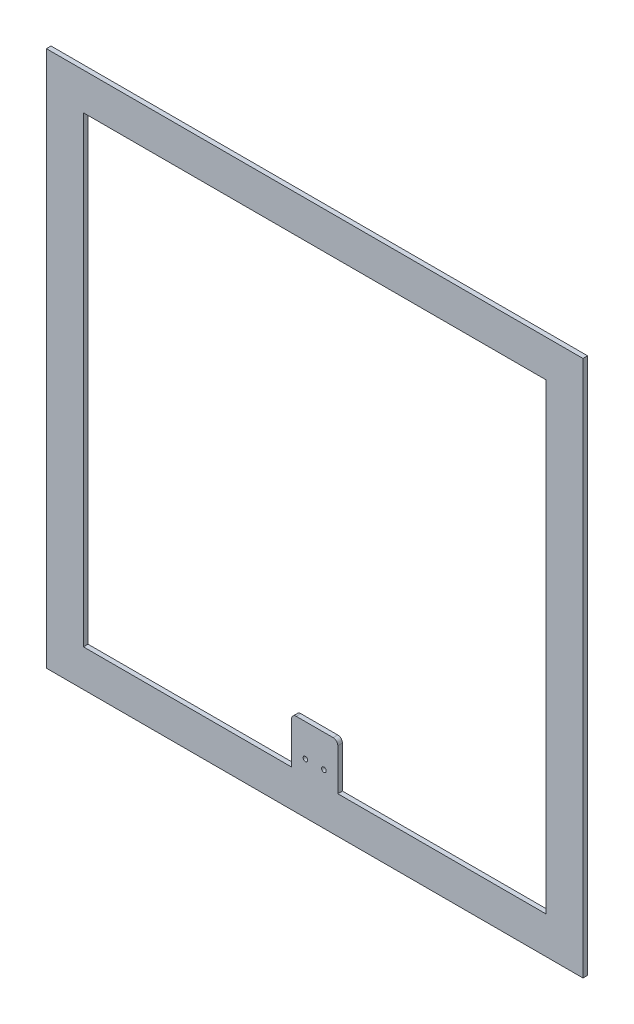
ISO-10303-21;
HEADER;
FILE_DESCRIPTION(('STEP AP214'),'2;1');
FILE_NAME('part.step','',(''),(''),'','','');
FILE_SCHEMA(('AUTOMOTIVE_DESIGN { 1 0 10303 214 1 1 1 1 }'));
ENDSEC;
DATA;
#1=APPLICATION_CONTEXT('core data for automotive mechanical design processes');
#2=APPLICATION_PROTOCOL_DEFINITION('international standard','automotive_design',2000,#1);
#3=PRODUCT_CONTEXT('',#1,'mechanical');
#4=PRODUCT('Part','Part','',(#3));
#5=PRODUCT_RELATED_PRODUCT_CATEGORY('part','',(#4));
#6=PRODUCT_DEFINITION_FORMATION('','',#4);
#7=PRODUCT_DEFINITION_CONTEXT('part definition',#1,'design');
#8=PRODUCT_DEFINITION('design','',#6,#7);
#9=PRODUCT_DEFINITION_SHAPE('','',#8);
#10=(LENGTH_UNIT() NAMED_UNIT(*) SI_UNIT(.MILLI.,.METRE.));
#11=(NAMED_UNIT(*) PLANE_ANGLE_UNIT() SI_UNIT($,.RADIAN.));
#12=(NAMED_UNIT(*) SI_UNIT($,.STERADIAN.) SOLID_ANGLE_UNIT());
#13=UNCERTAINTY_MEASURE_WITH_UNIT(LENGTH_MEASURE(1.E-05),#10,'distance_accuracy_value','');
#14=(GEOMETRIC_REPRESENTATION_CONTEXT(3) GLOBAL_UNCERTAINTY_ASSIGNED_CONTEXT((#13)) GLOBAL_UNIT_ASSIGNED_CONTEXT((#10,
#11,#12)) REPRESENTATION_CONTEXT('',''));
#15=CARTESIAN_POINT('',(0.,0.,0.));
#16=DIRECTION('',(0.,0.,1.));
#17=DIRECTION('',(1.,0.,0.));
#18=AXIS2_PLACEMENT_3D('',#15,#16,#17);
#19=CARTESIAN_POINT('',(0.,0.,5.));
#20=DIRECTION('',(0.,0.,1.));
#21=DIRECTION('',(1.,0.,0.));
#22=AXIS2_PLACEMENT_3D('',#19,#20,#21);
#23=PLANE('',#22);
#24=CARTESIAN_POINT('',(10.,-235.,5.));
#25=DIRECTION('',(0.,0.,1.));
#26=DIRECTION('',(-1.,0.,0.));
#27=AXIS2_PLACEMENT_3D('',#24,#25,#26);
#28=CIRCLE('',#27,2.5);
#29=CARTESIAN_POINT('',(7.5,-235.,5.));
#30=VERTEX_POINT('',#29);
#31=EDGE_CURVE('E306',#30,#30,#28,.T.);
#32=ORIENTED_EDGE('',*,*,#31,.F.);
#33=EDGE_LOOP('',(#32));
#34=FACE_BOUND('',#33,.T.);
#35=CARTESIAN_POINT('',(-10.,-235.,5.));
#36=DIRECTION('',(0.,0.,1.));
#37=DIRECTION('',(1.,0.,0.));
#38=AXIS2_PLACEMENT_3D('',#35,#36,#37);
#39=CIRCLE('',#38,2.5);
#40=CARTESIAN_POINT('',(-7.5,-235.,5.));
#41=VERTEX_POINT('',#40);
#42=EDGE_CURVE('E310',#41,#41,#39,.T.);
#43=ORIENTED_EDGE('',*,*,#42,.F.);
#44=EDGE_LOOP('',(#43));
#45=FACE_BOUND('',#44,.T.);
#46=DIRECTION('',(0.,1.,0.));
#47=VECTOR('',#46,1.);
#48=CARTESIAN_POINT('',(290.,290.,5.));
#49=LINE('',#48,#47);
#50=CARTESIAN_POINT('',(290.,-290.,5.));
#51=VERTEX_POINT('',#50);
#52=CARTESIAN_POINT('',(290.,290.,5.));
#53=VERTEX_POINT('',#52);
#54=EDGE_CURVE('E204',#51,#53,#49,.T.);
#55=ORIENTED_EDGE('',*,*,#54,.T.);
#56=DIRECTION('',(-1.,0.,0.));
#57=VECTOR('',#56,1.);
#58=CARTESIAN_POINT('',(-290.,290.,5.));
#59=LINE('',#58,#57);
#60=CARTESIAN_POINT('',(-290.,290.,5.));
#61=VERTEX_POINT('',#60);
#62=EDGE_CURVE('E207',#53,#61,#59,.T.);
#63=ORIENTED_EDGE('',*,*,#62,.T.);
#64=DIRECTION('',(0.,-1.,0.));
#65=VECTOR('',#64,1.);
#66=CARTESIAN_POINT('',(-290.,290.,5.));
#67=LINE('',#66,#65);
#68=CARTESIAN_POINT('',(-290.,-290.,5.));
#69=VERTEX_POINT('',#68);
#70=EDGE_CURVE('E210',#61,#69,#67,.T.);
#71=ORIENTED_EDGE('',*,*,#70,.T.);
#72=DIRECTION('',(1.,0.,0.));
#73=VECTOR('',#72,1.);
#74=CARTESIAN_POINT('',(-290.,-290.,5.));
#75=LINE('',#74,#73);
#76=EDGE_CURVE('E212',#69,#51,#75,.T.);
#77=ORIENTED_EDGE('',*,*,#76,.T.);
#78=EDGE_LOOP('',(#55,#63,#71,#77));
#79=FACE_BOUND('',#78,.T.);
#80=DIRECTION('',(0.,-1.,0.));
#81=VECTOR('',#80,1.);
#82=CARTESIAN_POINT('',(25.,-250.,5.));
#83=LINE('',#82,#81);
#84=CARTESIAN_POINT('',(25.,-205.,5.));
#85=VERTEX_POINT('',#84);
#86=CARTESIAN_POINT('',(25.,-250.,5.));
#87=VERTEX_POINT('',#86);
#88=EDGE_CURVE('E174',#85,#87,#83,.T.);
#89=ORIENTED_EDGE('',*,*,#88,.F.);
#90=CARTESIAN_POINT('',(20.,-205.,5.));
#91=DIRECTION('',(0.,0.,1.));
#92=DIRECTION('',(1.,0.,0.));
#93=AXIS2_PLACEMENT_3D('',#90,#91,#92);
#94=CIRCLE('',#93,5.);
#95=CARTESIAN_POINT('',(20.,-200.,5.));
#96=VERTEX_POINT('',#95);
#97=EDGE_CURVE('E41',#85,#96,#94,.T.);
#98=ORIENTED_EDGE('',*,*,#97,.T.);
#99=DIRECTION('',(1.,0.,0.));
#100=VECTOR('',#99,1.);
#101=CARTESIAN_POINT('',(-25.,-200.,5.));
#102=LINE('',#101,#100);
#103=CARTESIAN_POINT('',(-20.,-200.,5.));
#104=VERTEX_POINT('',#103);
#105=EDGE_CURVE('E171',#104,#96,#102,.T.);
#106=ORIENTED_EDGE('',*,*,#105,.F.);
#107=CARTESIAN_POINT('',(-20.,-205.,5.));
#108=DIRECTION('',(0.,0.,1.));
#109=DIRECTION('',(1.,0.,0.));
#110=AXIS2_PLACEMENT_3D('',#107,#108,#109);
#111=CIRCLE('',#110,5.);
#112=CARTESIAN_POINT('',(-25.,-205.,5.));
#113=VERTEX_POINT('',#112);
#114=EDGE_CURVE('E48',#104,#113,#111,.T.);
#115=ORIENTED_EDGE('',*,*,#114,.T.);
#116=DIRECTION('',(0.,1.,0.));
#117=VECTOR('',#116,1.);
#118=CARTESIAN_POINT('',(-25.,-250.,5.));
#119=LINE('',#118,#117);
#120=CARTESIAN_POINT('',(-25.,-250.,5.));
#121=VERTEX_POINT('',#120);
#122=EDGE_CURVE('E169',#121,#113,#119,.T.);
#123=ORIENTED_EDGE('',*,*,#122,.F.);
#124=DIRECTION('',(1.,0.,0.));
#125=VECTOR('',#124,1.);
#126=CARTESIAN_POINT('',(-250.,-250.,5.));
#127=LINE('',#126,#125);
#128=CARTESIAN_POINT('',(-250.,-250.,5.));
#129=VERTEX_POINT('',#128);
#130=EDGE_CURVE('E167',#129,#121,#127,.T.);
#131=ORIENTED_EDGE('',*,*,#130,.F.);
#132=DIRECTION('',(0.,-1.,0.));
#133=VECTOR('',#132,1.);
#134=CARTESIAN_POINT('',(-250.,250.,5.));
#135=LINE('',#134,#133);
#136=CARTESIAN_POINT('',(-250.,250.,5.));
#137=VERTEX_POINT('',#136);
#138=EDGE_CURVE('E162',#137,#129,#135,.T.);
#139=ORIENTED_EDGE('',*,*,#138,.F.);
#140=DIRECTION('',(-1.,0.,0.));
#141=VECTOR('',#140,1.);
#142=CARTESIAN_POINT('',(-250.,250.,5.));
#143=LINE('',#142,#141);
#144=CARTESIAN_POINT('',(250.,250.,5.));
#145=VERTEX_POINT('',#144);
#146=EDGE_CURVE('E160',#145,#137,#143,.T.);
#147=ORIENTED_EDGE('',*,*,#146,.F.);
#148=DIRECTION('',(0.,1.,0.));
#149=VECTOR('',#148,1.);
#150=CARTESIAN_POINT('',(250.,250.,5.));
#151=LINE('',#150,#149);
#152=CARTESIAN_POINT('',(250.,-250.,5.));
#153=VERTEX_POINT('',#152);
#154=EDGE_CURVE('E147',#153,#145,#151,.T.);
#155=ORIENTED_EDGE('',*,*,#154,.F.);
#156=DIRECTION('',(1.,0.,0.));
#157=VECTOR('',#156,1.);
#158=CARTESIAN_POINT('',(25.,-250.,5.));
#159=LINE('',#158,#157);
#160=EDGE_CURVE('E138',#87,#153,#159,.T.);
#161=ORIENTED_EDGE('',*,*,#160,.F.);
#162=EDGE_LOOP('',(#89,#98,#106,#115,#123,#131,#139,#147,#155,#161));
#163=FACE_BOUND('',#162,.T.);
#164=ADVANCED_FACE('F33',(#34,#45,#79,#163),#23,.T.);
#165=CARTESIAN_POINT('',(0.,0.,0.));
#166=DIRECTION('',(0.,0.,1.));
#167=DIRECTION('',(1.,0.,0.));
#168=AXIS2_PLACEMENT_3D('',#165,#166,#167);
#169=PLANE('',#168);
#170=CARTESIAN_POINT('',(10.,-235.,0.));
#171=DIRECTION('',(0.,0.,1.));
#172=DIRECTION('',(1.,0.,0.));
#173=AXIS2_PLACEMENT_3D('',#170,#171,#172);
#174=CIRCLE('',#173,2.5);
#175=CARTESIAN_POINT('',(12.5,-235.,0.));
#176=VERTEX_POINT('',#175);
#177=EDGE_CURVE('E309',#176,#176,#174,.F.);
#178=ORIENTED_EDGE('',*,*,#177,.F.);
#179=EDGE_LOOP('',(#178));
#180=FACE_BOUND('',#179,.T.);
#181=CARTESIAN_POINT('',(-10.,-235.,0.));
#182=DIRECTION('',(0.,0.,1.));
#183=DIRECTION('',(1.,0.,0.));
#184=AXIS2_PLACEMENT_3D('',#181,#182,#183);
#185=CIRCLE('',#184,2.5);
#186=CARTESIAN_POINT('',(-7.5,-235.,0.));
#187=VERTEX_POINT('',#186);
#188=EDGE_CURVE('E178',#187,#187,#185,.F.);
#189=ORIENTED_EDGE('',*,*,#188,.F.);
#190=EDGE_LOOP('',(#189));
#191=FACE_BOUND('',#190,.T.);
#192=DIRECTION('',(0.,1.,0.));
#193=VECTOR('',#192,1.);
#194=CARTESIAN_POINT('',(290.,290.,0.));
#195=LINE('',#194,#193);
#196=CARTESIAN_POINT('',(290.,-290.,0.));
#197=VERTEX_POINT('',#196);
#198=CARTESIAN_POINT('',(290.,290.,0.));
#199=VERTEX_POINT('',#198);
#200=EDGE_CURVE('E155',#197,#199,#195,.T.);
#201=ORIENTED_EDGE('',*,*,#200,.F.);
#202=DIRECTION('',(1.,0.,0.));
#203=VECTOR('',#202,1.);
#204=CARTESIAN_POINT('',(-290.,-290.,0.));
#205=LINE('',#204,#203);
#206=CARTESIAN_POINT('',(-290.,-290.,0.));
#207=VERTEX_POINT('',#206);
#208=EDGE_CURVE('E208',#207,#197,#205,.T.);
#209=ORIENTED_EDGE('',*,*,#208,.F.);
#210=DIRECTION('',(0.,-1.,0.));
#211=VECTOR('',#210,1.);
#212=CARTESIAN_POINT('',(-290.,290.,0.));
#213=LINE('',#212,#211);
#214=CARTESIAN_POINT('',(-290.,290.,0.));
#215=VERTEX_POINT('',#214);
#216=EDGE_CURVE('E219',#215,#207,#213,.T.);
#217=ORIENTED_EDGE('',*,*,#216,.F.);
#218=DIRECTION('',(-1.,0.,0.));
#219=VECTOR('',#218,1.);
#220=CARTESIAN_POINT('',(-290.,290.,0.));
#221=LINE('',#220,#219);
#222=EDGE_CURVE('E217',#199,#215,#221,.T.);
#223=ORIENTED_EDGE('',*,*,#222,.F.);
#224=EDGE_LOOP('',(#201,#209,#217,#223));
#225=FACE_BOUND('',#224,.T.);
#226=DIRECTION('',(1.,0.,0.));
#227=VECTOR('',#226,1.);
#228=CARTESIAN_POINT('',(-25.,-200.,0.));
#229=LINE('',#228,#227);
#230=CARTESIAN_POINT('',(-20.,-200.,0.));
#231=VERTEX_POINT('',#230);
#232=CARTESIAN_POINT('',(20.,-200.,0.));
#233=VERTEX_POINT('',#232);
#234=EDGE_CURVE('E192',#231,#233,#229,.T.);
#235=ORIENTED_EDGE('',*,*,#234,.T.);
#236=CARTESIAN_POINT('',(20.,-205.,0.));
#237=DIRECTION('',(0.,0.,1.));
#238=DIRECTION('',(1.,0.,0.));
#239=AXIS2_PLACEMENT_3D('',#236,#237,#238);
#240=CIRCLE('',#239,5.);
#241=CARTESIAN_POINT('',(25.,-205.,0.));
#242=VERTEX_POINT('',#241);
#243=EDGE_CURVE('E240',#233,#242,#240,.F.);
#244=ORIENTED_EDGE('',*,*,#243,.T.);
#245=DIRECTION('',(0.,-1.,0.));
#246=VECTOR('',#245,1.);
#247=CARTESIAN_POINT('',(25.,-250.,0.));
#248=LINE('',#247,#246);
#249=CARTESIAN_POINT('',(25.,-250.,0.));
#250=VERTEX_POINT('',#249);
#251=EDGE_CURVE('E148',#242,#250,#248,.T.);
#252=ORIENTED_EDGE('',*,*,#251,.T.);
#253=DIRECTION('',(1.,0.,0.));
#254=VECTOR('',#253,1.);
#255=CARTESIAN_POINT('',(25.,-250.,0.));
#256=LINE('',#255,#254);
#257=CARTESIAN_POINT('',(250.,-250.,0.));
#258=VERTEX_POINT('',#257);
#259=EDGE_CURVE('E176',#250,#258,#256,.T.);
#260=ORIENTED_EDGE('',*,*,#259,.T.);
#261=DIRECTION('',(0.,1.,0.));
#262=VECTOR('',#261,1.);
#263=CARTESIAN_POINT('',(250.,250.,0.));
#264=LINE('',#263,#262);
#265=CARTESIAN_POINT('',(250.,250.,0.));
#266=VERTEX_POINT('',#265);
#267=EDGE_CURVE('E154',#258,#266,#264,.T.);
#268=ORIENTED_EDGE('',*,*,#267,.T.);
#269=DIRECTION('',(-1.,0.,0.));
#270=VECTOR('',#269,1.);
#271=CARTESIAN_POINT('',(-250.,250.,0.));
#272=LINE('',#271,#270);
#273=CARTESIAN_POINT('',(-250.,250.,0.));
#274=VERTEX_POINT('',#273);
#275=EDGE_CURVE('E180',#266,#274,#272,.T.);
#276=ORIENTED_EDGE('',*,*,#275,.T.);
#277=DIRECTION('',(0.,-1.,0.));
#278=VECTOR('',#277,1.);
#279=CARTESIAN_POINT('',(-250.,250.,0.));
#280=LINE('',#279,#278);
#281=CARTESIAN_POINT('',(-250.,-250.,0.));
#282=VERTEX_POINT('',#281);
#283=EDGE_CURVE('E183',#274,#282,#280,.T.);
#284=ORIENTED_EDGE('',*,*,#283,.T.);
#285=DIRECTION('',(1.,0.,0.));
#286=VECTOR('',#285,1.);
#287=CARTESIAN_POINT('',(-250.,-250.,0.));
#288=LINE('',#287,#286);
#289=CARTESIAN_POINT('',(-25.,-250.,0.));
#290=VERTEX_POINT('',#289);
#291=EDGE_CURVE('E186',#282,#290,#288,.T.);
#292=ORIENTED_EDGE('',*,*,#291,.T.);
#293=DIRECTION('',(0.,1.,0.));
#294=VECTOR('',#293,1.);
#295=CARTESIAN_POINT('',(-25.,-250.,0.));
#296=LINE('',#295,#294);
#297=CARTESIAN_POINT('',(-25.,-205.,0.));
#298=VERTEX_POINT('',#297);
#299=EDGE_CURVE('E189',#290,#298,#296,.T.);
#300=ORIENTED_EDGE('',*,*,#299,.T.);
#301=CARTESIAN_POINT('',(-20.,-205.,0.));
#302=DIRECTION('',(0.,0.,1.));
#303=DIRECTION('',(1.,0.,0.));
#304=AXIS2_PLACEMENT_3D('',#301,#302,#303);
#305=CIRCLE('',#304,5.);
#306=EDGE_CURVE('E238',#298,#231,#305,.F.);
#307=ORIENTED_EDGE('',*,*,#306,.T.);
#308=EDGE_LOOP('',(#235,#244,#252,#260,#268,#276,#284,#292,#300,#307));
#309=FACE_BOUND('',#308,.T.);
#310=ADVANCED_FACE('F252',(#180,#191,#225,#309),#169,.F.);
#311=CARTESIAN_POINT('',(290.,290.,5.));
#312=DIRECTION('',(-1.,0.,0.));
#313=DIRECTION('',(0.,0.,1.));
#314=AXIS2_PLACEMENT_3D('',#311,#312,#313);
#315=PLANE('',#314);
#316=ORIENTED_EDGE('',*,*,#200,.T.);
#317=DIRECTION('',(0.,0.,-1.));
#318=VECTOR('',#317,1.);
#319=CARTESIAN_POINT('',(290.,290.,5.));
#320=LINE('',#319,#318);
#321=EDGE_CURVE('E230',#53,#199,#320,.T.);
#322=ORIENTED_EDGE('',*,*,#321,.F.);
#323=ORIENTED_EDGE('',*,*,#54,.F.);
#324=DIRECTION('',(0.,0.,-1.));
#325=VECTOR('',#324,1.);
#326=CARTESIAN_POINT('',(290.,-290.,5.));
#327=LINE('',#326,#325);
#328=EDGE_CURVE('E214',#51,#197,#327,.T.);
#329=ORIENTED_EDGE('',*,*,#328,.T.);
#330=EDGE_LOOP('',(#316,#322,#323,#329));
#331=FACE_BOUND('',#330,.T.);
#332=ADVANCED_FACE('F274',(#331),#315,.F.);
#333=CARTESIAN_POINT('',(-290.,290.,5.));
#334=DIRECTION('',(0.,-1.,0.));
#335=DIRECTION('',(0.,0.,-1.));
#336=AXIS2_PLACEMENT_3D('',#333,#334,#335);
#337=PLANE('',#336);
#338=ORIENTED_EDGE('',*,*,#222,.T.);
#339=DIRECTION('',(0.,0.,-1.));
#340=VECTOR('',#339,1.);
#341=CARTESIAN_POINT('',(-290.,290.,5.));
#342=LINE('',#341,#340);
#343=EDGE_CURVE('E227',#61,#215,#342,.T.);
#344=ORIENTED_EDGE('',*,*,#343,.F.);
#345=ORIENTED_EDGE('',*,*,#62,.F.);
#346=ORIENTED_EDGE('',*,*,#321,.T.);
#347=EDGE_LOOP('',(#338,#344,#345,#346));
#348=FACE_BOUND('',#347,.T.);
#349=ADVANCED_FACE('F289',(#348),#337,.F.);
#350=CARTESIAN_POINT('',(-290.,290.,5.));
#351=DIRECTION('',(1.,0.,0.));
#352=DIRECTION('',(0.,0.,-1.));
#353=AXIS2_PLACEMENT_3D('',#350,#351,#352);
#354=PLANE('',#353);
#355=ORIENTED_EDGE('',*,*,#216,.T.);
#356=DIRECTION('',(0.,0.,-1.));
#357=VECTOR('',#356,1.);
#358=CARTESIAN_POINT('',(-290.,-290.,5.));
#359=LINE('',#358,#357);
#360=EDGE_CURVE('E224',#69,#207,#359,.T.);
#361=ORIENTED_EDGE('',*,*,#360,.F.);
#362=ORIENTED_EDGE('',*,*,#70,.F.);
#363=ORIENTED_EDGE('',*,*,#343,.T.);
#364=EDGE_LOOP('',(#355,#361,#362,#363));
#365=FACE_BOUND('',#364,.T.);
#366=ADVANCED_FACE('F285',(#365),#354,.F.);
#367=CARTESIAN_POINT('',(-290.,-290.,5.));
#368=DIRECTION('',(0.,1.,0.));
#369=DIRECTION('',(0.,0.,1.));
#370=AXIS2_PLACEMENT_3D('',#367,#368,#369);
#371=PLANE('',#370);
#372=ORIENTED_EDGE('',*,*,#208,.T.);
#373=ORIENTED_EDGE('',*,*,#328,.F.);
#374=ORIENTED_EDGE('',*,*,#76,.F.);
#375=ORIENTED_EDGE('',*,*,#360,.T.);
#376=EDGE_LOOP('',(#372,#373,#374,#375));
#377=FACE_BOUND('',#376,.T.);
#378=ADVANCED_FACE('F282',(#377),#371,.F.);
#379=CARTESIAN_POINT('',(25.,-250.,5.));
#380=DIRECTION('',(0.,1.,0.));
#381=DIRECTION('',(0.,0.,1.));
#382=AXIS2_PLACEMENT_3D('',#379,#380,#381);
#383=PLANE('',#382);
#384=ORIENTED_EDGE('',*,*,#259,.F.);
#385=DIRECTION('',(0.,0.,-1.));
#386=VECTOR('',#385,1.);
#387=CARTESIAN_POINT('',(25.,-250.,5.));
#388=LINE('',#387,#386);
#389=EDGE_CURVE('E145',#87,#250,#388,.T.);
#390=ORIENTED_EDGE('',*,*,#389,.F.);
#391=ORIENTED_EDGE('',*,*,#160,.T.);
#392=DIRECTION('',(0.,0.,-1.));
#393=VECTOR('',#392,1.);
#394=CARTESIAN_POINT('',(250.,-250.,5.));
#395=LINE('',#394,#393);
#396=EDGE_CURVE('E142',#153,#258,#395,.T.);
#397=ORIENTED_EDGE('',*,*,#396,.T.);
#398=EDGE_LOOP('',(#384,#390,#391,#397));
#399=FACE_BOUND('',#398,.T.);
#400=ADVANCED_FACE('F141',(#399),#383,.T.);
#401=CARTESIAN_POINT('',(250.,250.,5.));
#402=DIRECTION('',(-1.,0.,0.));
#403=DIRECTION('',(0.,0.,1.));
#404=AXIS2_PLACEMENT_3D('',#401,#402,#403);
#405=PLANE('',#404);
#406=ORIENTED_EDGE('',*,*,#267,.F.);
#407=ORIENTED_EDGE('',*,*,#396,.F.);
#408=ORIENTED_EDGE('',*,*,#154,.T.);
#409=DIRECTION('',(0.,0.,-1.));
#410=VECTOR('',#409,1.);
#411=CARTESIAN_POINT('',(250.,250.,5.));
#412=LINE('',#411,#410);
#413=EDGE_CURVE('E156',#145,#266,#412,.T.);
#414=ORIENTED_EDGE('',*,*,#413,.T.);
#415=EDGE_LOOP('',(#406,#407,#408,#414));
#416=FACE_BOUND('',#415,.T.);
#417=ADVANCED_FACE('F151',(#416),#405,.T.);
#418=CARTESIAN_POINT('',(-250.,250.,5.));
#419=DIRECTION('',(0.,-1.,0.));
#420=DIRECTION('',(0.,0.,-1.));
#421=AXIS2_PLACEMENT_3D('',#418,#419,#420);
#422=PLANE('',#421);
#423=ORIENTED_EDGE('',*,*,#275,.F.);
#424=ORIENTED_EDGE('',*,*,#413,.F.);
#425=ORIENTED_EDGE('',*,*,#146,.T.);
#426=DIRECTION('',(0.,0.,-1.));
#427=VECTOR('',#426,1.);
#428=CARTESIAN_POINT('',(-250.,250.,5.));
#429=LINE('',#428,#427);
#430=EDGE_CURVE('E201',#137,#274,#429,.T.);
#431=ORIENTED_EDGE('',*,*,#430,.T.);
#432=EDGE_LOOP('',(#423,#424,#425,#431));
#433=FACE_BOUND('',#432,.T.);
#434=ADVANCED_FACE('F370',(#433),#422,.T.);
#435=CARTESIAN_POINT('',(-250.,250.,5.));
#436=DIRECTION('',(1.,0.,0.));
#437=DIRECTION('',(0.,0.,-1.));
#438=AXIS2_PLACEMENT_3D('',#435,#436,#437);
#439=PLANE('',#438);
#440=ORIENTED_EDGE('',*,*,#283,.F.);
#441=ORIENTED_EDGE('',*,*,#430,.F.);
#442=ORIENTED_EDGE('',*,*,#138,.T.);
#443=DIRECTION('',(0.,0.,-1.));
#444=VECTOR('',#443,1.);
#445=CARTESIAN_POINT('',(-250.,-250.,5.));
#446=LINE('',#445,#444);
#447=EDGE_CURVE('E199',#129,#282,#446,.T.);
#448=ORIENTED_EDGE('',*,*,#447,.T.);
#449=EDGE_LOOP('',(#440,#441,#442,#448));
#450=FACE_BOUND('',#449,.T.);
#451=ADVANCED_FACE('F363',(#450),#439,.T.);
#452=CARTESIAN_POINT('',(-250.,-250.,5.));
#453=DIRECTION('',(0.,1.,0.));
#454=DIRECTION('',(0.,0.,1.));
#455=AXIS2_PLACEMENT_3D('',#452,#453,#454);
#456=PLANE('',#455);
#457=ORIENTED_EDGE('',*,*,#291,.F.);
#458=ORIENTED_EDGE('',*,*,#447,.F.);
#459=ORIENTED_EDGE('',*,*,#130,.T.);
#460=DIRECTION('',(0.,0.,-1.));
#461=VECTOR('',#460,1.);
#462=CARTESIAN_POINT('',(-25.,-250.,5.));
#463=LINE('',#462,#461);
#464=EDGE_CURVE('E197',#121,#290,#463,.T.);
#465=ORIENTED_EDGE('',*,*,#464,.T.);
#466=EDGE_LOOP('',(#457,#458,#459,#465));
#467=FACE_BOUND('',#466,.T.);
#468=ADVANCED_FACE('F354',(#467),#456,.T.);
#469=CARTESIAN_POINT('',(-25.,-250.,5.));
#470=DIRECTION('',(-1.,0.,0.));
#471=DIRECTION('',(0.,-1.,0.));
#472=AXIS2_PLACEMENT_3D('',#469,#470,#471);
#473=PLANE('',#472);
#474=ORIENTED_EDGE('',*,*,#122,.T.);
#475=DIRECTION('',(0.,0.,-1.));
#476=VECTOR('',#475,1.);
#477=CARTESIAN_POINT('',(-25.,-205.,5.));
#478=LINE('',#477,#476);
#479=EDGE_CURVE('E11',#113,#298,#478,.T.);
#480=ORIENTED_EDGE('',*,*,#479,.T.);
#481=ORIENTED_EDGE('',*,*,#299,.F.);
#482=ORIENTED_EDGE('',*,*,#464,.F.);
#483=EDGE_LOOP('',(#474,#480,#481,#482));
#484=FACE_BOUND('',#483,.T.);
#485=ADVANCED_FACE('F265',(#484),#473,.T.);
#486=CARTESIAN_POINT('',(-25.,-200.,5.));
#487=DIRECTION('',(0.,1.,0.));
#488=DIRECTION('',(0.,0.,1.));
#489=AXIS2_PLACEMENT_3D('',#486,#487,#488);
#490=PLANE('',#489);
#491=ORIENTED_EDGE('',*,*,#105,.T.);
#492=DIRECTION('',(0.,0.,-1.));
#493=VECTOR('',#492,1.);
#494=CARTESIAN_POINT('',(20.,-200.,5.));
#495=LINE('',#494,#493);
#496=EDGE_CURVE('E235',#96,#233,#495,.T.);
#497=ORIENTED_EDGE('',*,*,#496,.T.);
#498=ORIENTED_EDGE('',*,*,#234,.F.);
#499=DIRECTION('',(0.,0.,-1.));
#500=VECTOR('',#499,1.);
#501=CARTESIAN_POINT('',(-20.,-200.,5.));
#502=LINE('',#501,#500);
#503=EDGE_CURVE('E233',#231,#104,#502,.F.);
#504=ORIENTED_EDGE('',*,*,#503,.T.);
#505=EDGE_LOOP('',(#491,#497,#498,#504));
#506=FACE_BOUND('',#505,.T.);
#507=ADVANCED_FACE('F247',(#506),#490,.T.);
#508=CARTESIAN_POINT('',(25.,-250.,5.));
#509=DIRECTION('',(1.,0.,0.));
#510=DIRECTION('',(0.,1.,0.));
#511=AXIS2_PLACEMENT_3D('',#508,#509,#510);
#512=PLANE('',#511);
#513=ORIENTED_EDGE('',*,*,#251,.F.);
#514=DIRECTION('',(0.,0.,-1.));
#515=VECTOR('',#514,1.);
#516=CARTESIAN_POINT('',(25.,-205.,5.));
#517=LINE('',#516,#515);
#518=EDGE_CURVE('E56',#242,#85,#517,.F.);
#519=ORIENTED_EDGE('',*,*,#518,.T.);
#520=ORIENTED_EDGE('',*,*,#88,.T.);
#521=ORIENTED_EDGE('',*,*,#389,.T.);
#522=EDGE_LOOP('',(#513,#519,#520,#521));
#523=FACE_BOUND('',#522,.T.);
#524=ADVANCED_FACE('F253',(#523),#512,.T.);
#525=CARTESIAN_POINT('',(-10.,-235.,-0.00100000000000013));
#526=DIRECTION('',(0.,0.,1.));
#527=DIRECTION('',(1.,0.,0.));
#528=AXIS2_PLACEMENT_3D('',#525,#526,#527);
#529=CYLINDRICAL_SURFACE('',#528,2.5);
#530=ORIENTED_EDGE('',*,*,#42,.T.);
#531=EDGE_LOOP('',(#530));
#532=FACE_BOUND('',#531,.T.);
#533=ORIENTED_EDGE('',*,*,#188,.T.);
#534=EDGE_LOOP('',(#533));
#535=FACE_BOUND('',#534,.T.);
#536=ADVANCED_FACE('F255',(#532,#535),#529,.F.);
#537=CARTESIAN_POINT('',(10.,-235.,-0.00100000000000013));
#538=DIRECTION('',(0.,0.,1.));
#539=DIRECTION('',(1.,0.,0.));
#540=AXIS2_PLACEMENT_3D('',#537,#538,#539);
#541=CYLINDRICAL_SURFACE('',#540,2.5);
#542=ORIENTED_EDGE('',*,*,#31,.T.);
#543=EDGE_LOOP('',(#542));
#544=FACE_BOUND('',#543,.T.);
#545=ORIENTED_EDGE('',*,*,#177,.T.);
#546=EDGE_LOOP('',(#545));
#547=FACE_BOUND('',#546,.T.);
#548=ADVANCED_FACE('F262',(#544,#547),#541,.F.);
#549=CARTESIAN_POINT('',(20.,-205.,5.));
#550=DIRECTION('',(0.,0.,-1.));
#551=DIRECTION('',(-1.,0.,0.));
#552=AXIS2_PLACEMENT_3D('',#549,#550,#551);
#553=CYLINDRICAL_SURFACE('',#552,5.);
#554=ORIENTED_EDGE('',*,*,#97,.F.);
#555=ORIENTED_EDGE('',*,*,#518,.F.);
#556=ORIENTED_EDGE('',*,*,#243,.F.);
#557=ORIENTED_EDGE('',*,*,#496,.F.);
#558=EDGE_LOOP('',(#554,#555,#556,#557));
#559=FACE_BOUND('',#558,.T.);
#560=ADVANCED_FACE('F250',(#559),#553,.T.);
#561=CARTESIAN_POINT('',(-20.,-205.,5.));
#562=DIRECTION('',(0.,0.,-1.));
#563=DIRECTION('',(-1.,0.,0.));
#564=AXIS2_PLACEMENT_3D('',#561,#562,#563);
#565=CYLINDRICAL_SURFACE('',#564,5.);
#566=ORIENTED_EDGE('',*,*,#114,.F.);
#567=ORIENTED_EDGE('',*,*,#503,.F.);
#568=ORIENTED_EDGE('',*,*,#306,.F.);
#569=ORIENTED_EDGE('',*,*,#479,.F.);
#570=EDGE_LOOP('',(#566,#567,#568,#569));
#571=FACE_BOUND('',#570,.T.);
#572=ADVANCED_FACE('F35',(#571),#565,.T.);
#573=CLOSED_SHELL('',(#164,#310,#332,#349,#366,#378,#400,#417,#434,#451,#468,#485,#507,#524,
#536,#548,#560,#572));
#574=MANIFOLD_SOLID_BREP('B2',#573);
#575=ADVANCED_BREP_SHAPE_REPRESENTATION('',(#18,#574),#14);
#576=SHAPE_DEFINITION_REPRESENTATION(#9,#575);
ENDSEC;
END-ISO-10303-21;
